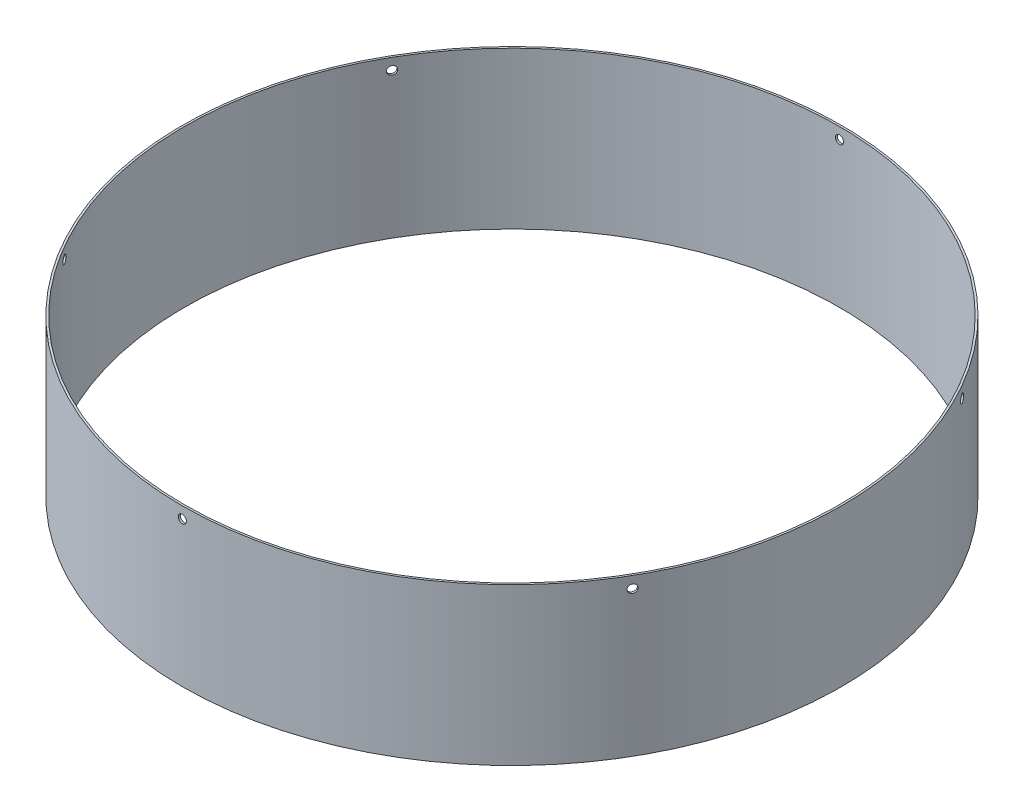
from build123d import *

# Parameters (mm, degrees)
SKETCH1_R          = 146.939
SKETCH1_R_2        = 146.05
EXTRUDE1_DEPTH     = 69.85
SKETCH2_R          = 1.8288
CUT_EXTRUDE1_DEPTH = 177.8
CIRPATTERN1_COUNT  = 6


with BuildPart() as part:
    # Sketch1 → Extrude1 (new body)
    with BuildSketch(Plane(origin=(0, 0, 0), x_dir=(1, 0, 0), z_dir=(0, 1, 0))):
        with Locations(Location((0, 0, 0), (0, 0, 270))):
            Circle(SKETCH1_R)
        with Locations(Location((0, 0, 0), (0, 0, 270))):
            Circle(SKETCH1_R_2, mode=Mode.SUBTRACT)
    extrude(amount=EXTRUDE1_DEPTH)

    # Sketch2 → Cut-Extrude1 (cut, symmetric)
    with BuildSketch(Plane.XY):
        with Locations((0, 64.77)):
            Circle(SKETCH2_R)
    cut_extrude1 = extrude(amount=CUT_EXTRUDE1_DEPTH, both=True, mode=Mode.SUBTRACT)

    # CirPattern1: Cut-Extrude1 ×6 about axis
    cirpattern1_axis = Axis((0, 69.85, 0), (0, -1, 0))
    for i in range(1, CIRPATTERN1_COUNT):
        add(cut_extrude1.rotate(cirpattern1_axis, i * 360 / CIRPATTERN1_COUNT), mode=Mode.SUBTRACT)


solid = part.part
